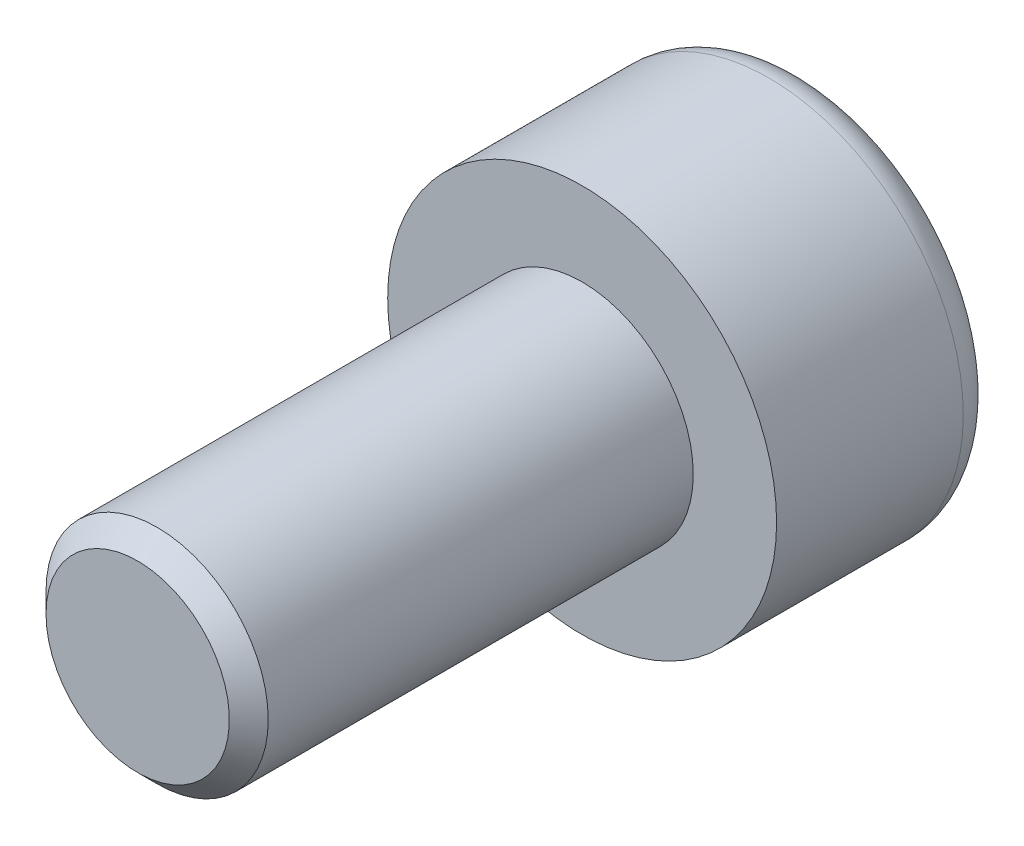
ISO-10303-21;
HEADER;
FILE_DESCRIPTION(('STEP AP214'),'2;1');
FILE_NAME('part.step','',(''),(''),'','','');
FILE_SCHEMA(('AUTOMOTIVE_DESIGN { 1 0 10303 214 1 1 1 1 }'));
ENDSEC;
DATA;
#1=APPLICATION_CONTEXT('core data for automotive mechanical design processes');
#2=APPLICATION_PROTOCOL_DEFINITION('international standard','automotive_design',2000,#1);
#3=PRODUCT_CONTEXT('',#1,'mechanical');
#4=PRODUCT('Part','Part','',(#3));
#5=PRODUCT_RELATED_PRODUCT_CATEGORY('part','',(#4));
#6=PRODUCT_DEFINITION_FORMATION('','',#4);
#7=PRODUCT_DEFINITION_CONTEXT('part definition',#1,'design');
#8=PRODUCT_DEFINITION('design','',#6,#7);
#9=PRODUCT_DEFINITION_SHAPE('','',#8);
#10=(LENGTH_UNIT() NAMED_UNIT(*) SI_UNIT(.MILLI.,.METRE.));
#11=(NAMED_UNIT(*) PLANE_ANGLE_UNIT() SI_UNIT($,.RADIAN.));
#12=(NAMED_UNIT(*) SI_UNIT($,.STERADIAN.) SOLID_ANGLE_UNIT());
#13=UNCERTAINTY_MEASURE_WITH_UNIT(LENGTH_MEASURE(1.E-05),#10,'distance_accuracy_value','');
#14=(GEOMETRIC_REPRESENTATION_CONTEXT(3) GLOBAL_UNCERTAINTY_ASSIGNED_CONTEXT((#13)) GLOBAL_UNIT_ASSIGNED_CONTEXT((#10,
#11,#12)) REPRESENTATION_CONTEXT('',''));
#15=CARTESIAN_POINT('',(0.,0.,0.));
#16=DIRECTION('',(0.,0.,1.));
#17=DIRECTION('',(1.,0.,0.));
#18=AXIS2_PLACEMENT_3D('',#15,#16,#17);
#19=CARTESIAN_POINT('',(0.,0.,-4.));
#20=DIRECTION('',(0.,0.,1.));
#21=DIRECTION('',(1.,0.,0.));
#22=AXIS2_PLACEMENT_3D('',#19,#20,#21);
#23=PLANE('',#22);
#24=CARTESIAN_POINT('',(0.,0.,-4.));
#25=DIRECTION('',(0.,0.,-1.));
#26=DIRECTION('',(-1.,0.,0.));
#27=AXIS2_PLACEMENT_3D('',#24,#25,#26);
#28=CIRCLE('',#27,2.86);
#29=CARTESIAN_POINT('',(-2.86,0.,-4.));
#30=VERTEX_POINT('',#29);
#31=EDGE_CURVE('E139',#30,#30,#28,.T.);
#32=ORIENTED_EDGE('',*,*,#31,.T.);
#33=EDGE_LOOP('',(#32));
#34=FACE_BOUND('',#33,.T.);
#35=DIRECTION('',(-0.86602540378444,0.499999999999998,0.));
#36=VECTOR('',#35,1.);
#37=CARTESIAN_POINT('',(0.,1.73205080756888,-4.));
#38=LINE('',#37,#36);
#39=CARTESIAN_POINT('',(1.5,0.866025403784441,-4.));
#40=VERTEX_POINT('',#39);
#41=CARTESIAN_POINT('',(0.,1.73205080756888,-4.));
#42=VERTEX_POINT('',#41);
#43=EDGE_CURVE('E43',#40,#42,#38,.T.);
#44=ORIENTED_EDGE('',*,*,#43,.T.);
#45=DIRECTION('',(-0.866025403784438,-0.500000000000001,0.));
#46=VECTOR('',#45,1.);
#47=CARTESIAN_POINT('',(0.,1.73205080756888,-4.));
#48=LINE('',#47,#46);
#49=CARTESIAN_POINT('',(-1.5,0.866025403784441,-4.));
#50=VERTEX_POINT('',#49);
#51=EDGE_CURVE('E83',#42,#50,#48,.T.);
#52=ORIENTED_EDGE('',*,*,#51,.T.);
#53=DIRECTION('',(0.,-1.,0.));
#54=VECTOR('',#53,1.);
#55=CARTESIAN_POINT('',(-1.5,-0.866025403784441,-4.));
#56=LINE('',#55,#54);
#57=CARTESIAN_POINT('',(-1.5,-0.866025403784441,-4.));
#58=VERTEX_POINT('',#57);
#59=EDGE_CURVE('E91',#50,#58,#56,.T.);
#60=ORIENTED_EDGE('',*,*,#59,.T.);
#61=DIRECTION('',(0.866025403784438,-0.500000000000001,0.));
#62=VECTOR('',#61,1.);
#63=CARTESIAN_POINT('',(0.,-1.73205080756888,-4.));
#64=LINE('',#63,#62);
#65=CARTESIAN_POINT('',(0.,-1.73205080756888,-4.));
#66=VERTEX_POINT('',#65);
#67=EDGE_CURVE('E109',#58,#66,#64,.T.);
#68=ORIENTED_EDGE('',*,*,#67,.T.);
#69=DIRECTION('',(0.86602540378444,0.499999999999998,0.));
#70=VECTOR('',#69,1.);
#71=CARTESIAN_POINT('',(0.,-1.73205080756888,-4.));
#72=LINE('',#71,#70);
#73=CARTESIAN_POINT('',(1.5,-0.866025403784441,-4.));
#74=VERTEX_POINT('',#73);
#75=EDGE_CURVE('E112',#66,#74,#72,.T.);
#76=ORIENTED_EDGE('',*,*,#75,.T.);
#77=DIRECTION('',(0.,1.,0.));
#78=VECTOR('',#77,1.);
#79=CARTESIAN_POINT('',(1.5,-0.866025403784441,-4.));
#80=LINE('',#79,#78);
#81=EDGE_CURVE('E102',#74,#40,#80,.T.);
#82=ORIENTED_EDGE('',*,*,#81,.T.);
#83=EDGE_LOOP('',(#44,#52,#60,#68,#76,#82));
#84=FACE_BOUND('',#83,.T.);
#85=ADVANCED_FACE('F29',(#34,#84),#23,.F.);
#86=CARTESIAN_POINT('',(0.,0.,-3.36));
#87=DIRECTION('',(0.,0.,-1.));
#88=DIRECTION('',(-1.,0.,0.));
#89=AXIS2_PLACEMENT_3D('',#86,#87,#88);
#90=TOROIDAL_SURFACE('',#89,2.86,0.64);
#91=ORIENTED_EDGE('',*,*,#31,.F.);
#92=EDGE_LOOP('',(#91));
#93=FACE_BOUND('',#92,.T.);
#94=CARTESIAN_POINT('',(0.,0.,-3.36));
#95=DIRECTION('',(0.,0.,-1.));
#96=DIRECTION('',(-1.,0.,0.));
#97=AXIS2_PLACEMENT_3D('',#94,#95,#96);
#98=CIRCLE('',#97,3.5);
#99=CARTESIAN_POINT('',(-3.5,0.,-3.36));
#100=VERTEX_POINT('',#99);
#101=EDGE_CURVE('E136',#100,#100,#98,.T.);
#102=ORIENTED_EDGE('',*,*,#101,.T.);
#103=EDGE_LOOP('',(#102));
#104=FACE_BOUND('',#103,.T.);
#105=ADVANCED_FACE('F158',(#93,#104),#90,.T.);
#106=CARTESIAN_POINT('',(0.,0.,0.));
#107=DIRECTION('',(0.,0.,-1.));
#108=DIRECTION('',(-1.,0.,0.));
#109=AXIS2_PLACEMENT_3D('',#106,#107,#108);
#110=CYLINDRICAL_SURFACE('',#109,3.5);
#111=ORIENTED_EDGE('',*,*,#101,.F.);
#112=EDGE_LOOP('',(#111));
#113=FACE_BOUND('',#112,.T.);
#114=CARTESIAN_POINT('',(0.,0.,0.));
#115=DIRECTION('',(0.,0.,-1.));
#116=DIRECTION('',(-1.,0.,0.));
#117=AXIS2_PLACEMENT_3D('',#114,#115,#116);
#118=CIRCLE('',#117,3.5);
#119=CARTESIAN_POINT('',(-3.5,0.,0.));
#120=VERTEX_POINT('',#119);
#121=EDGE_CURVE('E97',#120,#120,#118,.T.);
#122=ORIENTED_EDGE('',*,*,#121,.T.);
#123=EDGE_LOOP('',(#122));
#124=FACE_BOUND('',#123,.T.);
#125=ADVANCED_FACE('F163',(#113,#124),#110,.T.);
#126=CARTESIAN_POINT('',(0.,0.,0.));
#127=DIRECTION('',(0.,0.,-1.));
#128=DIRECTION('',(-1.,0.,0.));
#129=AXIS2_PLACEMENT_3D('',#126,#127,#128);
#130=PLANE('',#129);
#131=CARTESIAN_POINT('',(0.,0.,0.));
#132=DIRECTION('',(0.,0.,1.));
#133=DIRECTION('',(1.,0.,0.));
#134=AXIS2_PLACEMENT_3D('',#131,#132,#133);
#135=CIRCLE('',#134,2.);
#136=CARTESIAN_POINT('',(2.,0.,0.));
#137=VERTEX_POINT('',#136);
#138=EDGE_CURVE('E103',#137,#137,#135,.T.);
#139=ORIENTED_EDGE('',*,*,#138,.F.);
#140=EDGE_LOOP('',(#139));
#141=FACE_BOUND('',#140,.T.);
#142=ORIENTED_EDGE('',*,*,#121,.F.);
#143=EDGE_LOOP('',(#142));
#144=FACE_BOUND('',#143,.T.);
#145=ADVANCED_FACE('F171',(#141,#144),#130,.F.);
#146=CARTESIAN_POINT('',(0.,1.73205080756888,-2.));
#147=DIRECTION('',(-0.499999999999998,-0.86602540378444,0.));
#148=DIRECTION('',(0.86602540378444,-0.499999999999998,0.));
#149=AXIS2_PLACEMENT_3D('',#146,#147,#148);
#150=PLANE('',#149);
#151=ORIENTED_EDGE('',*,*,#43,.F.);
#152=DIRECTION('',(0.,0.,-1.));
#153=VECTOR('',#152,1.);
#154=CARTESIAN_POINT('',(1.5,0.866025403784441,-2.));
#155=LINE('',#154,#153);
#156=CARTESIAN_POINT('',(1.5,0.866025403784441,-2.));
#157=VERTEX_POINT('',#156);
#158=EDGE_CURVE('E125',#157,#40,#155,.T.);
#159=ORIENTED_EDGE('',*,*,#158,.F.);
#160=DIRECTION('',(-0.86602540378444,0.499999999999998,0.));
#161=VECTOR('',#160,1.);
#162=CARTESIAN_POINT('',(0.,1.73205080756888,-2.));
#163=LINE('',#162,#161);
#164=CARTESIAN_POINT('',(0.,1.73205080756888,-2.));
#165=VERTEX_POINT('',#164);
#166=EDGE_CURVE('E96',#157,#165,#163,.T.);
#167=ORIENTED_EDGE('',*,*,#166,.T.);
#168=DIRECTION('',(0.,0.,-1.));
#169=VECTOR('',#168,1.);
#170=CARTESIAN_POINT('',(0.,1.73205080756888,-2.));
#171=LINE('',#170,#169);
#172=EDGE_CURVE('E85',#165,#42,#171,.T.);
#173=ORIENTED_EDGE('',*,*,#172,.T.);
#174=EDGE_LOOP('',(#151,#159,#167,#173));
#175=FACE_BOUND('',#174,.T.);
#176=ADVANCED_FACE('F94',(#175),#150,.T.);
#177=CARTESIAN_POINT('',(0.,1.73205080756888,-2.));
#178=DIRECTION('',(0.500000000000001,-0.866025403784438,0.));
#179=DIRECTION('',(0.866025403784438,0.500000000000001,0.));
#180=AXIS2_PLACEMENT_3D('',#177,#178,#179);
#181=PLANE('',#180);
#182=ORIENTED_EDGE('',*,*,#51,.F.);
#183=ORIENTED_EDGE('',*,*,#172,.F.);
#184=DIRECTION('',(-0.866025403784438,-0.500000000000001,0.));
#185=VECTOR('',#184,1.);
#186=CARTESIAN_POINT('',(0.,1.73205080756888,-2.));
#187=LINE('',#186,#185);
#188=CARTESIAN_POINT('',(-1.5,0.866025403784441,-2.));
#189=VERTEX_POINT('',#188);
#190=EDGE_CURVE('E116',#165,#189,#187,.T.);
#191=ORIENTED_EDGE('',*,*,#190,.T.);
#192=DIRECTION('',(0.,0.,-1.));
#193=VECTOR('',#192,1.);
#194=CARTESIAN_POINT('',(-1.5,0.866025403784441,-2.));
#195=LINE('',#194,#193);
#196=EDGE_CURVE('E87',#189,#50,#195,.T.);
#197=ORIENTED_EDGE('',*,*,#196,.T.);
#198=EDGE_LOOP('',(#182,#183,#191,#197));
#199=FACE_BOUND('',#198,.T.);
#200=ADVANCED_FACE('F84',(#199),#181,.T.);
#201=CARTESIAN_POINT('',(-1.5,-0.866025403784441,-2.));
#202=DIRECTION('',(1.,0.,0.));
#203=DIRECTION('',(0.,0.,-1.));
#204=AXIS2_PLACEMENT_3D('',#201,#202,#203);
#205=PLANE('',#204);
#206=ORIENTED_EDGE('',*,*,#59,.F.);
#207=ORIENTED_EDGE('',*,*,#196,.F.);
#208=DIRECTION('',(0.,-1.,0.));
#209=VECTOR('',#208,1.);
#210=CARTESIAN_POINT('',(-1.5,-0.866025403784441,-2.));
#211=LINE('',#210,#209);
#212=CARTESIAN_POINT('',(-1.5,-0.866025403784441,-2.));
#213=VERTEX_POINT('',#212);
#214=EDGE_CURVE('E118',#189,#213,#211,.T.);
#215=ORIENTED_EDGE('',*,*,#214,.T.);
#216=DIRECTION('',(0.,0.,-1.));
#217=VECTOR('',#216,1.);
#218=CARTESIAN_POINT('',(-1.5,-0.866025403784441,-2.));
#219=LINE('',#218,#217);
#220=EDGE_CURVE('E131',#213,#58,#219,.T.);
#221=ORIENTED_EDGE('',*,*,#220,.T.);
#222=EDGE_LOOP('',(#206,#207,#215,#221));
#223=FACE_BOUND('',#222,.T.);
#224=ADVANCED_FACE('F186',(#223),#205,.T.);
#225=CARTESIAN_POINT('',(0.,-1.73205080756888,-2.));
#226=DIRECTION('',(0.500000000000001,0.866025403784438,0.));
#227=DIRECTION('',(-0.866025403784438,0.500000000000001,0.));
#228=AXIS2_PLACEMENT_3D('',#225,#226,#227);
#229=PLANE('',#228);
#230=ORIENTED_EDGE('',*,*,#67,.F.);
#231=ORIENTED_EDGE('',*,*,#220,.F.);
#232=DIRECTION('',(0.866025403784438,-0.500000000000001,0.));
#233=VECTOR('',#232,1.);
#234=CARTESIAN_POINT('',(0.,-1.73205080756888,-2.));
#235=LINE('',#234,#233);
#236=CARTESIAN_POINT('',(0.,-1.73205080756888,-2.));
#237=VERTEX_POINT('',#236);
#238=EDGE_CURVE('E120',#213,#237,#235,.T.);
#239=ORIENTED_EDGE('',*,*,#238,.T.);
#240=DIRECTION('',(0.,0.,-1.));
#241=VECTOR('',#240,1.);
#242=CARTESIAN_POINT('',(0.,-1.73205080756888,-2.));
#243=LINE('',#242,#241);
#244=EDGE_CURVE('E129',#237,#66,#243,.T.);
#245=ORIENTED_EDGE('',*,*,#244,.T.);
#246=EDGE_LOOP('',(#230,#231,#239,#245));
#247=FACE_BOUND('',#246,.T.);
#248=ADVANCED_FACE('F189',(#247),#229,.T.);
#249=CARTESIAN_POINT('',(0.,-1.73205080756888,-2.));
#250=DIRECTION('',(-0.499999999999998,0.86602540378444,0.));
#251=DIRECTION('',(-0.86602540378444,-0.499999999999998,0.));
#252=AXIS2_PLACEMENT_3D('',#249,#250,#251);
#253=PLANE('',#252);
#254=ORIENTED_EDGE('',*,*,#75,.F.);
#255=ORIENTED_EDGE('',*,*,#244,.F.);
#256=DIRECTION('',(0.86602540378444,0.499999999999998,0.));
#257=VECTOR('',#256,1.);
#258=CARTESIAN_POINT('',(0.,-1.73205080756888,-2.));
#259=LINE('',#258,#257);
#260=CARTESIAN_POINT('',(1.5,-0.866025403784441,-2.));
#261=VERTEX_POINT('',#260);
#262=EDGE_CURVE('E122',#237,#261,#259,.T.);
#263=ORIENTED_EDGE('',*,*,#262,.T.);
#264=DIRECTION('',(0.,0.,-1.));
#265=VECTOR('',#264,1.);
#266=CARTESIAN_POINT('',(1.5,-0.866025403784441,-2.));
#267=LINE('',#266,#265);
#268=EDGE_CURVE('E127',#261,#74,#267,.T.);
#269=ORIENTED_EDGE('',*,*,#268,.T.);
#270=EDGE_LOOP('',(#254,#255,#263,#269));
#271=FACE_BOUND('',#270,.T.);
#272=ADVANCED_FACE('F193',(#271),#253,.T.);
#273=CARTESIAN_POINT('',(1.5,-0.866025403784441,-2.));
#274=DIRECTION('',(-1.,0.,0.));
#275=DIRECTION('',(0.,0.,1.));
#276=AXIS2_PLACEMENT_3D('',#273,#274,#275);
#277=PLANE('',#276);
#278=ORIENTED_EDGE('',*,*,#81,.F.);
#279=ORIENTED_EDGE('',*,*,#268,.F.);
#280=DIRECTION('',(0.,1.,0.));
#281=VECTOR('',#280,1.);
#282=CARTESIAN_POINT('',(1.5,-0.866025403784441,-2.));
#283=LINE('',#282,#281);
#284=EDGE_CURVE('E50',#261,#157,#283,.T.);
#285=ORIENTED_EDGE('',*,*,#284,.T.);
#286=ORIENTED_EDGE('',*,*,#158,.T.);
#287=EDGE_LOOP('',(#278,#279,#285,#286));
#288=FACE_BOUND('',#287,.T.);
#289=ADVANCED_FACE('F197',(#288),#277,.T.);
#290=CARTESIAN_POINT('',(1.5,0.866025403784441,-2.));
#291=DIRECTION('',(0.,0.,1.));
#292=DIRECTION('',(1.,0.,0.));
#293=AXIS2_PLACEMENT_3D('',#290,#291,#292);
#294=PLANE('',#293);
#295=ORIENTED_EDGE('',*,*,#166,.F.);
#296=ORIENTED_EDGE('',*,*,#284,.F.);
#297=ORIENTED_EDGE('',*,*,#262,.F.);
#298=ORIENTED_EDGE('',*,*,#238,.F.);
#299=ORIENTED_EDGE('',*,*,#214,.F.);
#300=ORIENTED_EDGE('',*,*,#190,.F.);
#301=EDGE_LOOP('',(#295,#296,#297,#298,#299,#300));
#302=FACE_BOUND('',#301,.T.);
#303=ADVANCED_FACE('F201',(#302),#294,.F.);
#304=CARTESIAN_POINT('',(0.,0.,8.));
#305=DIRECTION('',(0.,0.,1.));
#306=DIRECTION('',(1.,0.,0.));
#307=AXIS2_PLACEMENT_3D('',#304,#305,#306);
#308=PLANE('',#307);
#309=CARTESIAN_POINT('',(0.,0.,8.));
#310=DIRECTION('',(0.,0.,1.));
#311=DIRECTION('',(1.,0.,0.));
#312=AXIS2_PLACEMENT_3D('',#309,#310,#311);
#313=CIRCLE('',#312,1.65);
#314=CARTESIAN_POINT('',(-1.65,0.,8.));
#315=VERTEX_POINT('',#314);
#316=EDGE_CURVE('E36',#315,#315,#313,.T.);
#317=ORIENTED_EDGE('',*,*,#316,.T.);
#318=EDGE_LOOP('',(#317));
#319=FACE_BOUND('',#318,.T.);
#320=ADVANCED_FACE('F144',(#319),#308,.T.);
#321=CARTESIAN_POINT('',(0.,0.,0.));
#322=DIRECTION('',(0.,0.,1.));
#323=DIRECTION('',(1.,0.,0.));
#324=AXIS2_PLACEMENT_3D('',#321,#322,#323);
#325=CYLINDRICAL_SURFACE('',#324,2.);
#326=CARTESIAN_POINT('',(0.,0.,7.65));
#327=DIRECTION('',(0.,0.,1.));
#328=DIRECTION('',(1.,0.,0.));
#329=AXIS2_PLACEMENT_3D('',#326,#327,#328);
#330=CIRCLE('',#329,2.);
#331=CARTESIAN_POINT('',(-2.,0.,7.65));
#332=VERTEX_POINT('',#331);
#333=EDGE_CURVE('E11',#332,#332,#330,.F.);
#334=ORIENTED_EDGE('',*,*,#333,.T.);
#335=EDGE_LOOP('',(#334));
#336=FACE_BOUND('',#335,.T.);
#337=ORIENTED_EDGE('',*,*,#138,.T.);
#338=EDGE_LOOP('',(#337));
#339=FACE_BOUND('',#338,.T.);
#340=ADVANCED_FACE('F148',(#336,#339),#325,.T.);
#341=CARTESIAN_POINT('',(0.,0.,8.));
#342=DIRECTION('',(0.,0.,-1.));
#343=DIRECTION('',(-1.,0.,0.));
#344=AXIS2_PLACEMENT_3D('',#341,#342,#343);
#345=CONICAL_SURFACE('',#344,1.65,0.785398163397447);
#346=CARTESIAN_POINT('',(-2.,0.,7.65));
#347=CARTESIAN_POINT('',(-1.99635416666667,0.,7.65364583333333));
#348=CARTESIAN_POINT('',(-1.99270833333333,0.,7.65729166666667));
#349=CARTESIAN_POINT('',(-1.98541666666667,0.,7.66458333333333));
#350=CARTESIAN_POINT('',(-1.98177083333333,0.,7.66822916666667));
#351=CARTESIAN_POINT('',(-1.97447916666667,0.,7.67552083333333));
#352=CARTESIAN_POINT('',(-1.97083333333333,0.,7.67916666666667));
#353=CARTESIAN_POINT('',(-1.96354166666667,0.,7.68645833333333));
#354=CARTESIAN_POINT('',(-1.95989583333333,0.,7.69010416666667));
#355=CARTESIAN_POINT('',(-1.95260416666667,0.,7.69739583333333));
#356=CARTESIAN_POINT('',(-1.94895833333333,0.,7.70104166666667));
#357=CARTESIAN_POINT('',(-1.94166666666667,0.,7.70833333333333));
#358=CARTESIAN_POINT('',(-1.93802083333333,0.,7.71197916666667));
#359=CARTESIAN_POINT('',(-1.93072916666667,0.,7.71927083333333));
#360=CARTESIAN_POINT('',(-1.92708333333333,0.,7.72291666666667));
#361=CARTESIAN_POINT('',(-1.91979166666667,0.,7.73020833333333));
#362=CARTESIAN_POINT('',(-1.91614583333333,0.,7.73385416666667));
#363=CARTESIAN_POINT('',(-1.90885416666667,0.,7.74114583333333));
#364=CARTESIAN_POINT('',(-1.90520833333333,0.,7.74479166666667));
#365=CARTESIAN_POINT('',(-1.89791666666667,0.,7.75208333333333));
#366=CARTESIAN_POINT('',(-1.89427083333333,0.,7.75572916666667));
#367=CARTESIAN_POINT('',(-1.88697916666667,0.,7.76302083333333));
#368=CARTESIAN_POINT('',(-1.88333333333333,0.,7.76666666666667));
#369=CARTESIAN_POINT('',(-1.87604166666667,0.,7.77395833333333));
#370=CARTESIAN_POINT('',(-1.87239583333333,0.,7.77760416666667));
#371=CARTESIAN_POINT('',(-1.86510416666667,0.,7.78489583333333));
#372=CARTESIAN_POINT('',(-1.86145833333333,0.,7.78854166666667));
#373=CARTESIAN_POINT('',(-1.85416666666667,0.,7.79583333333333));
#374=CARTESIAN_POINT('',(-1.85052083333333,0.,7.79947916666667));
#375=CARTESIAN_POINT('',(-1.84322916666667,0.,7.80677083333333));
#376=CARTESIAN_POINT('',(-1.83958333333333,0.,7.81041666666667));
#377=CARTESIAN_POINT('',(-1.83229166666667,0.,7.81770833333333));
#378=CARTESIAN_POINT('',(-1.82864583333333,0.,7.82135416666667));
#379=CARTESIAN_POINT('',(-1.82135416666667,0.,7.82864583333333));
#380=CARTESIAN_POINT('',(-1.81770833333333,0.,7.83229166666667));
#381=CARTESIAN_POINT('',(-1.81041666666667,0.,7.83958333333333));
#382=CARTESIAN_POINT('',(-1.80677083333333,0.,7.84322916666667));
#383=CARTESIAN_POINT('',(-1.79947916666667,0.,7.85052083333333));
#384=CARTESIAN_POINT('',(-1.79583333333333,0.,7.85416666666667));
#385=CARTESIAN_POINT('',(-1.78854166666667,0.,7.86145833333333));
#386=CARTESIAN_POINT('',(-1.78489583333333,0.,7.86510416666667));
#387=CARTESIAN_POINT('',(-1.77760416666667,0.,7.87239583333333));
#388=CARTESIAN_POINT('',(-1.77395833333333,0.,7.87604166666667));
#389=CARTESIAN_POINT('',(-1.76666666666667,0.,7.88333333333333));
#390=CARTESIAN_POINT('',(-1.76302083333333,0.,7.88697916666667));
#391=CARTESIAN_POINT('',(-1.75572916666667,0.,7.89427083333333));
#392=CARTESIAN_POINT('',(-1.75208333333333,0.,7.89791666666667));
#393=CARTESIAN_POINT('',(-1.74479166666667,0.,7.90520833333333));
#394=CARTESIAN_POINT('',(-1.74114583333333,0.,7.90885416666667));
#395=CARTESIAN_POINT('',(-1.73385416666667,0.,7.91614583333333));
#396=CARTESIAN_POINT('',(-1.73020833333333,0.,7.91979166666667));
#397=CARTESIAN_POINT('',(-1.72291666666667,0.,7.92708333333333));
#398=CARTESIAN_POINT('',(-1.71927083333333,0.,7.93072916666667));
#399=CARTESIAN_POINT('',(-1.71197916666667,0.,7.93802083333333));
#400=CARTESIAN_POINT('',(-1.70833333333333,0.,7.94166666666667));
#401=CARTESIAN_POINT('',(-1.70104166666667,0.,7.94895833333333));
#402=CARTESIAN_POINT('',(-1.69739583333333,0.,7.95260416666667));
#403=CARTESIAN_POINT('',(-1.69010416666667,0.,7.95989583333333));
#404=CARTESIAN_POINT('',(-1.68645833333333,0.,7.96354166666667));
#405=CARTESIAN_POINT('',(-1.67916666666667,0.,7.97083333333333));
#406=CARTESIAN_POINT('',(-1.67552083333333,0.,7.97447916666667));
#407=CARTESIAN_POINT('',(-1.66822916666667,0.,7.98177083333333));
#408=CARTESIAN_POINT('',(-1.66458333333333,0.,7.98541666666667));
#409=CARTESIAN_POINT('',(-1.65729166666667,0.,7.99270833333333));
#410=CARTESIAN_POINT('',(-1.65364583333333,0.,7.99635416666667));
#411=CARTESIAN_POINT('',(-1.65,0.,8.));
#412=B_SPLINE_CURVE_WITH_KNOTS('',3,(#346,#347,#348,#349,#350,#351,#352,#353,#354,#355,#356,
#357,#358,#359,#360,#361,#362,#363,#364,#365,#366,#367,#368,#369,#370,#371,#372,#373,#374,#375,
#376,#377,#378,#379,#380,#381,#382,#383,#384,#385,#386,#387,#388,#389,#390,#391,#392,#393,#394,
#395,#396,#397,#398,#399,#400,#401,#402,#403,#404,#405,#406,#407,#408,#409,#410,#411),
.UNSPECIFIED.,.F.,.F.,(4,2,2,2,2,2,2,2,2,2,2,2,2,2,2,2,2,2,2,2,2,2,2,2,2,2,2,2,2,2,2,2,4),(0.,
0.0154679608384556,0.0309359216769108,0.046403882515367,0.0618718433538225,0.0773398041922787,
0.0928077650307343,0.10827572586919,0.123743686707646,0.139211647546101,0.154679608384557,
0.170147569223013,0.185615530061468,0.201083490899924,0.21655145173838,0.232019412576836,
0.247487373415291,0.262955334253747,0.278423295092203,0.293891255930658,0.309359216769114,
0.32482717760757,0.340295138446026,0.355763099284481,0.371231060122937,0.386699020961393,
0.402166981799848,0.417634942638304,0.43310290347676,0.448570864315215,0.464038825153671,
0.479506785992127,0.494974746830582),.UNSPECIFIED.);
#413=EDGE_CURVE('BSEAM146',#332,#315,#412,.T.);
#414=ORIENTED_EDGE('',*,*,#333,.F.);
#415=ORIENTED_EDGE('',*,*,#316,.F.);
#416=ORIENTED_EDGE('',*,*,#413,.T.);
#417=ORIENTED_EDGE('',*,*,#413,.F.);
#418=EDGE_LOOP('',(#414,#416,#415,#417));
#419=FACE_BOUND('',#418,.T.);
#420=ADVANCED_FACE('F146',(#419),#345,.T.);
#421=CLOSED_SHELL('',(#85,#105,#125,#145,#176,#200,#224,#248,#272,#289,#303,#320,#340,#420));
#422=MANIFOLD_SOLID_BREP('B2',#421);
#423=ADVANCED_BREP_SHAPE_REPRESENTATION('',(#18,#422),#14);
#424=SHAPE_DEFINITION_REPRESENTATION(#9,#423);
ENDSEC;
END-ISO-10303-21;
